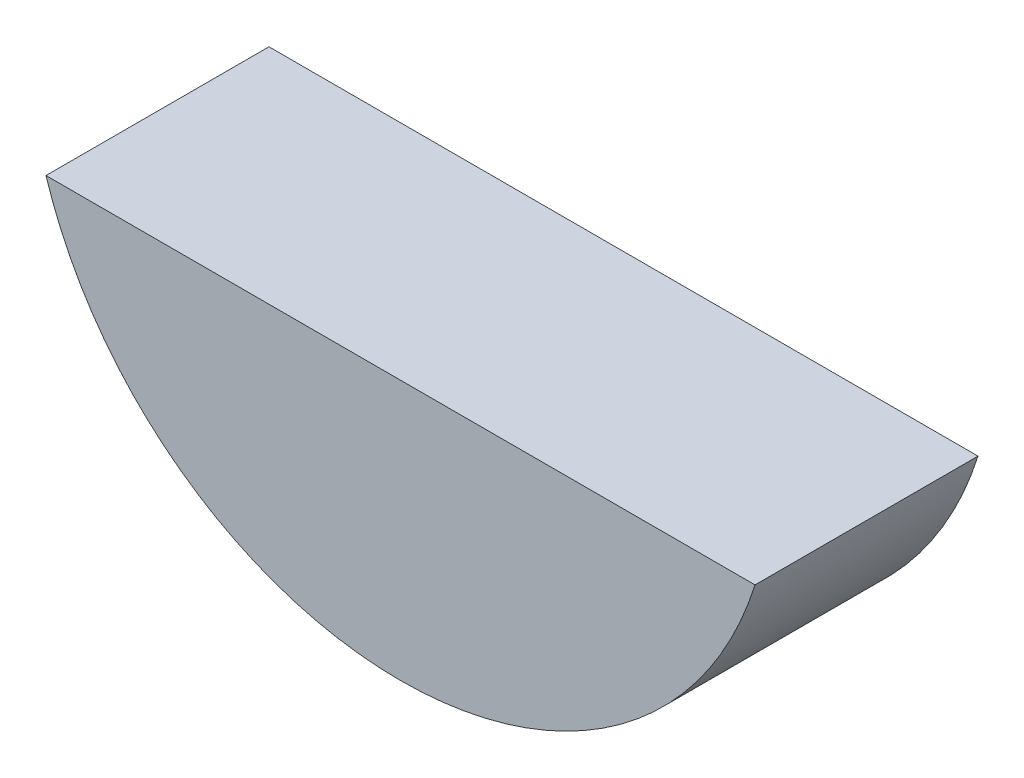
ISO-10303-21;
HEADER;
FILE_DESCRIPTION(('STEP AP214'),'2;1');
FILE_NAME('part.step','',(''),(''),'','','');
FILE_SCHEMA(('AUTOMOTIVE_DESIGN { 1 0 10303 214 1 1 1 1 }'));
ENDSEC;
DATA;
#1=APPLICATION_CONTEXT('core data for automotive mechanical design processes');
#2=APPLICATION_PROTOCOL_DEFINITION('international standard','automotive_design',2000,#1);
#3=PRODUCT_CONTEXT('',#1,'mechanical');
#4=PRODUCT('Part','Part','',(#3));
#5=PRODUCT_RELATED_PRODUCT_CATEGORY('part','',(#4));
#6=PRODUCT_DEFINITION_FORMATION('','',#4);
#7=PRODUCT_DEFINITION_CONTEXT('part definition',#1,'design');
#8=PRODUCT_DEFINITION('design','',#6,#7);
#9=PRODUCT_DEFINITION_SHAPE('','',#8);
#10=(LENGTH_UNIT() NAMED_UNIT(*) SI_UNIT(.MILLI.,.METRE.));
#11=(NAMED_UNIT(*) PLANE_ANGLE_UNIT() SI_UNIT($,.RADIAN.));
#12=(NAMED_UNIT(*) SI_UNIT($,.STERADIAN.) SOLID_ANGLE_UNIT());
#13=UNCERTAINTY_MEASURE_WITH_UNIT(LENGTH_MEASURE(1.E-05),#10,'distance_accuracy_value','');
#14=(GEOMETRIC_REPRESENTATION_CONTEXT(3) GLOBAL_UNCERTAINTY_ASSIGNED_CONTEXT((#13)) GLOBAL_UNIT_ASSIGNED_CONTEXT((#10,
#11,#12)) REPRESENTATION_CONTEXT('',''));
#15=CARTESIAN_POINT('',(0.,0.,0.));
#16=DIRECTION('',(0.,0.,1.));
#17=DIRECTION('',(1.,0.,0.));
#18=AXIS2_PLACEMENT_3D('',#15,#16,#17);
#19=CARTESIAN_POINT('',(0.,0.,1.5));
#20=DIRECTION('',(0.,0.,1.));
#21=DIRECTION('',(1.,0.,0.));
#22=AXIS2_PLACEMENT_3D('',#19,#20,#21);
#23=PLANE('',#22);
#24=DIRECTION('',(1.,0.,0.));
#25=VECTOR('',#24,1.);
#26=CARTESIAN_POINT('',(4.769696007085,0.,1.5));
#27=LINE('',#26,#25);
#28=CARTESIAN_POINT('',(-4.76969600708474,0.,1.5));
#29=VERTEX_POINT('',#28);
#30=CARTESIAN_POINT('',(4.76969600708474,0.,1.5));
#31=VERTEX_POINT('',#30);
#32=EDGE_CURVE('E40',#29,#31,#27,.T.);
#33=ORIENTED_EDGE('',*,*,#32,.F.);
#34=CARTESIAN_POINT('',(0.,1.5,1.5));
#35=DIRECTION('',(0.,0.,1.));
#36=DIRECTION('',(1.,0.,0.));
#37=AXIS2_PLACEMENT_3D('',#34,#35,#36);
#38=CIRCLE('',#37,5.);
#39=EDGE_CURVE('E20',#31,#29,#38,.F.);
#40=ORIENTED_EDGE('',*,*,#39,.F.);
#41=EDGE_LOOP('',(#33,#40));
#42=FACE_BOUND('',#41,.T.);
#43=ADVANCED_FACE('F16',(#42),#23,.T.);
#44=CARTESIAN_POINT('',(4.769696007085,0.,-1.5));
#45=DIRECTION('',(0.,1.,0.));
#46=DIRECTION('',(0.,0.,1.));
#47=AXIS2_PLACEMENT_3D('',#44,#45,#46);
#48=PLANE('',#47);
#49=DIRECTION('',(0.,0.,1.));
#50=VECTOR('',#49,1.);
#51=CARTESIAN_POINT('',(4.76969600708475,0.,-1.5));
#52=LINE('',#51,#50);
#53=CARTESIAN_POINT('',(4.76969600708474,0.,-1.5));
#54=VERTEX_POINT('',#53);
#55=EDGE_CURVE('E44',#54,#31,#52,.T.);
#56=ORIENTED_EDGE('',*,*,#55,.F.);
#57=DIRECTION('',(1.,0.,0.));
#58=VECTOR('',#57,1.);
#59=CARTESIAN_POINT('',(0.,0.,-1.5));
#60=LINE('',#59,#58);
#61=CARTESIAN_POINT('',(-4.76969600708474,0.,-1.5));
#62=VERTEX_POINT('',#61);
#63=EDGE_CURVE('E33',#54,#62,#60,.F.);
#64=ORIENTED_EDGE('',*,*,#63,.T.);
#65=DIRECTION('',(0.,0.,1.));
#66=VECTOR('',#65,1.);
#67=CARTESIAN_POINT('',(-4.76969600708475,0.,-1.5));
#68=LINE('',#67,#66);
#69=EDGE_CURVE('E26',#29,#62,#68,.F.);
#70=ORIENTED_EDGE('',*,*,#69,.F.);
#71=ORIENTED_EDGE('',*,*,#32,.T.);
#72=EDGE_LOOP('',(#56,#64,#70,#71));
#73=FACE_BOUND('',#72,.T.);
#74=ADVANCED_FACE('F42',(#73),#48,.T.);
#75=CARTESIAN_POINT('',(0.,0.,-1.5));
#76=DIRECTION('',(0.,0.,1.));
#77=DIRECTION('',(1.,0.,0.));
#78=AXIS2_PLACEMENT_3D('',#75,#76,#77);
#79=PLANE('',#78);
#80=CARTESIAN_POINT('',(0.,1.5,-1.5));
#81=DIRECTION('',(0.,0.,1.));
#82=DIRECTION('',(1.,0.,0.));
#83=AXIS2_PLACEMENT_3D('',#80,#81,#82);
#84=CIRCLE('',#83,5.);
#85=EDGE_CURVE('E11',#62,#54,#84,.T.);
#86=ORIENTED_EDGE('',*,*,#85,.F.);
#87=ORIENTED_EDGE('',*,*,#63,.F.);
#88=EDGE_LOOP('',(#86,#87));
#89=FACE_BOUND('',#88,.T.);
#90=ADVANCED_FACE('F54',(#89),#79,.F.);
#91=CARTESIAN_POINT('',(0.,1.5,-1.5));
#92=DIRECTION('',(0.,0.,1.));
#93=DIRECTION('',(1.,0.,0.));
#94=AXIS2_PLACEMENT_3D('',#91,#92,#93);
#95=CYLINDRICAL_SURFACE('',#94,5.);
#96=ORIENTED_EDGE('',*,*,#69,.T.);
#97=ORIENTED_EDGE('',*,*,#85,.T.);
#98=ORIENTED_EDGE('',*,*,#55,.T.);
#99=ORIENTED_EDGE('',*,*,#39,.T.);
#100=EDGE_LOOP('',(#96,#97,#98,#99));
#101=FACE_BOUND('',#100,.T.);
#102=ADVANCED_FACE('F18',(#101),#95,.T.);
#103=CLOSED_SHELL('',(#43,#74,#90,#102));
#104=MANIFOLD_SOLID_BREP('B1',#103);
#105=ADVANCED_BREP_SHAPE_REPRESENTATION('',(#18,#104),#14);
#106=SHAPE_DEFINITION_REPRESENTATION(#9,#105);
ENDSEC;
END-ISO-10303-21;
